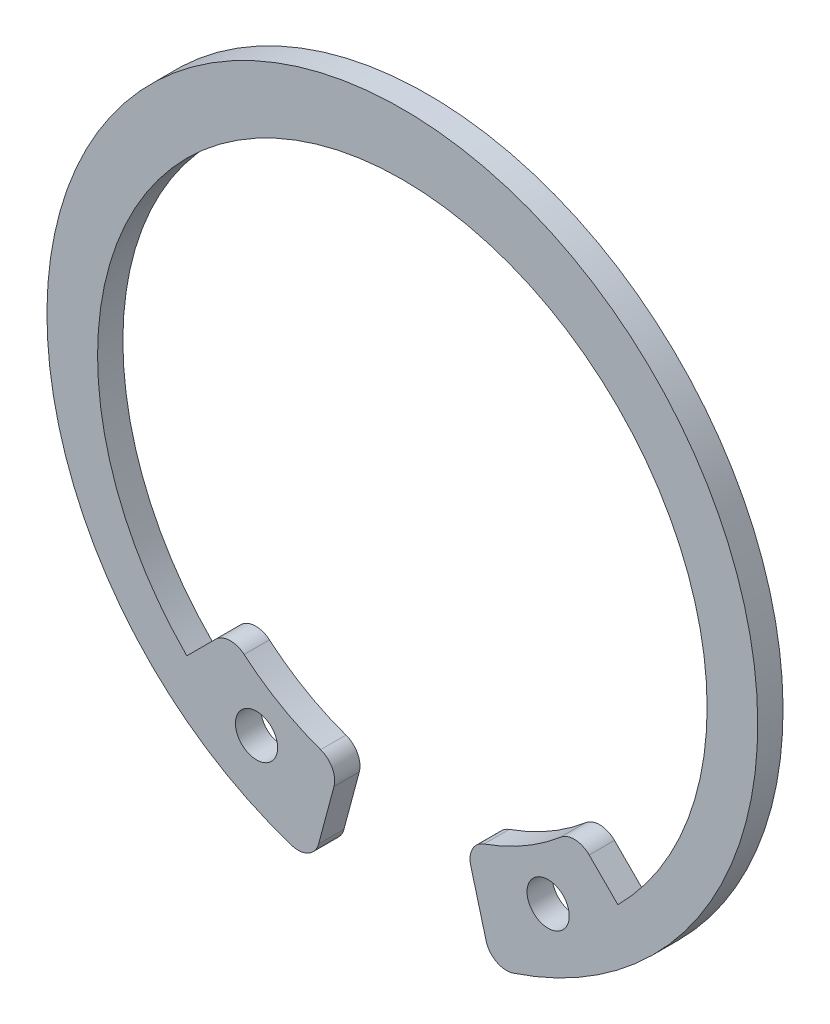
from build123d import *

# Parameters (mm, degrees)
ESQUISSE1_R          = 1
BASE_EXTRUSION_DEPTH = 1.2


with BuildPart() as part:
    # Esquisse1 → Base-Extrusion (new body)
    with BuildSketch(Plane.XY):
        with BuildLine():
            Line((3.971088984, -14.82030585), (3.242145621, -12.099852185))
            ThreePointArc((3.242145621, -12.099852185), (3.322823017, -11.375914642), (3.873208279, -10.898766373))
            ThreePointArc((3.873208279, -10.898766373), (5.783270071, -10.016917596), (7.50200441, -8.803679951))
            ThreePointArc((7.50200441, -8.803679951), (8.190419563, -8.565606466), (8.857706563, -8.857706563))
            Line((8.857706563, -8.857706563), (10.217692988, -10.217692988))
            ThreePointArc((10.217692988, -10.217692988), (0, 14.45), (-10.217692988, -10.217692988))
            Line((-10.217692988, -10.217692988), (-8.857706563, -8.857706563))
            ThreePointArc((-8.857706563, -8.857706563), (-8.190419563, -8.565606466), (-7.50200441, -8.803679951))
            ThreePointArc((-7.50200441, -8.803679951), (-5.783270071, -10.016917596), (-3.873208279, -10.898766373))
            ThreePointArc((-3.873208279, -10.898766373), (-3.322823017, -11.375914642), (-3.242145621, -12.099852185))
            Line((-3.242145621, -12.099852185), (-3.971088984, -14.82030585))
            ThreePointArc((-3.971088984, -14.82030585), (-4.460996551, -15.440922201), (-5.248498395, -15.511738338))
            ThreePointArc((-5.248498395, -15.511738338), (0, 17.35), (5.248498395, -15.511738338))
            ThreePointArc((5.248498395, -15.511738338), (4.460996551, -15.440922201), (3.971088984, -14.82030585))
        make_face()
        with Locations((-6.912155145, -11.838886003)):
            Circle(ESQUISSE1_R, mode=Mode.SUBTRACT)
        with Locations(Location((6.912155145, -11.838886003, 0), (0, 0, 180))):
            Circle(ESQUISSE1_R, mode=Mode.SUBTRACT)
    extrude(amount=BASE_EXTRUSION_DEPTH)


solid = part.part
